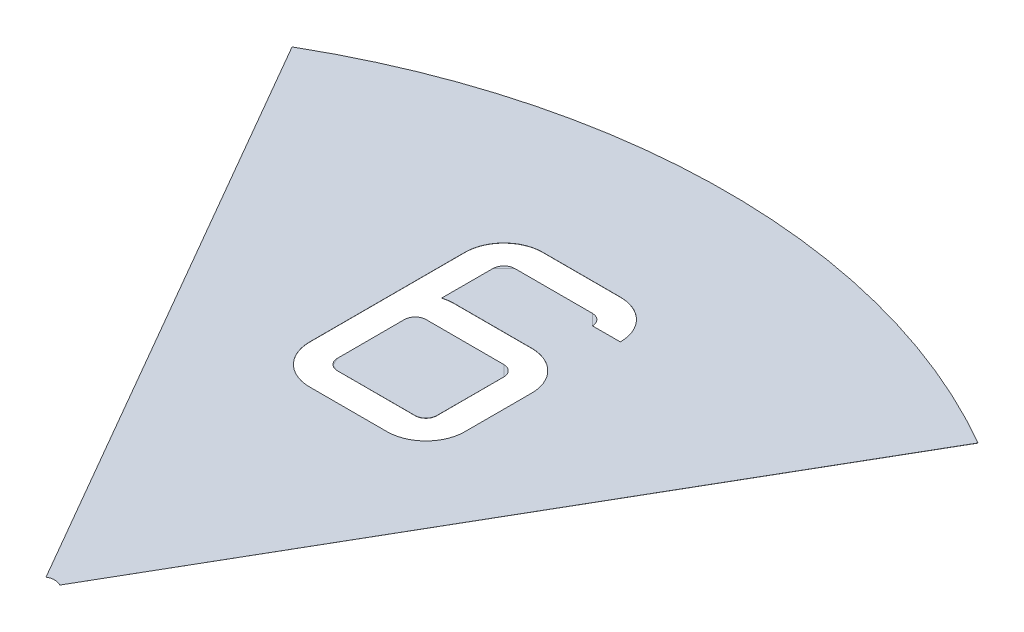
ISO-10303-21;
HEADER;
FILE_DESCRIPTION(('STEP AP214'),'2;1');
FILE_NAME('part.step','',(''),(''),'','','');
FILE_SCHEMA(('AUTOMOTIVE_DESIGN { 1 0 10303 214 1 1 1 1 }'));
ENDSEC;
DATA;
#1=APPLICATION_CONTEXT('core data for automotive mechanical design processes');
#2=APPLICATION_PROTOCOL_DEFINITION('international standard','automotive_design',2000,#1);
#3=PRODUCT_CONTEXT('',#1,'mechanical');
#4=PRODUCT('Part','Part','',(#3));
#5=PRODUCT_RELATED_PRODUCT_CATEGORY('part','',(#4));
#6=PRODUCT_DEFINITION_FORMATION('','',#4);
#7=PRODUCT_DEFINITION_CONTEXT('part definition',#1,'design');
#8=PRODUCT_DEFINITION('design','',#6,#7);
#9=PRODUCT_DEFINITION_SHAPE('','',#8);
#10=(LENGTH_UNIT() NAMED_UNIT(*) SI_UNIT(.MILLI.,.METRE.));
#11=(NAMED_UNIT(*) PLANE_ANGLE_UNIT() SI_UNIT($,.RADIAN.));
#12=(NAMED_UNIT(*) SI_UNIT($,.STERADIAN.) SOLID_ANGLE_UNIT());
#13=UNCERTAINTY_MEASURE_WITH_UNIT(LENGTH_MEASURE(1.E-05),#10,'distance_accuracy_value','');
#14=(GEOMETRIC_REPRESENTATION_CONTEXT(3) GLOBAL_UNCERTAINTY_ASSIGNED_CONTEXT((#13)) GLOBAL_UNIT_ASSIGNED_CONTEXT((#10,
#11,#12)) REPRESENTATION_CONTEXT('',''));
#15=CARTESIAN_POINT('',(0.,0.,0.));
#16=DIRECTION('',(0.,0.,1.));
#17=DIRECTION('',(1.,0.,0.));
#18=AXIS2_PLACEMENT_3D('',#15,#16,#17);
#19=CARTESIAN_POINT('',(-11.9472987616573,-17.8161671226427,-20.0961047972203));
#20=DIRECTION('',(0.,1.,0.));
#21=DIRECTION('',(0.,0.,1.));
#22=AXIS2_PLACEMENT_3D('',#19,#20,#21);
#23=CYLINDRICAL_SURFACE('',#22,0.7905);
#24=CARTESIAN_POINT('',(-11.9472987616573,-7.82616712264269,-20.0961047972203));
#25=DIRECTION('',(0.,1.,0.));
#26=DIRECTION('',(0.,0.,1.));
#27=AXIS2_PLACEMENT_3D('',#24,#25,#26);
#28=CIRCLE('',#27,0.7905);
#29=CARTESIAN_POINT('',(-11.9472987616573,-7.82616712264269,-20.8866047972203));
#30=VERTEX_POINT('',#29);
#31=CARTESIAN_POINT('',(-12.7377987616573,-7.82616712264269,-20.0961047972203));
#32=VERTEX_POINT('',#31);
#33=EDGE_CURVE('P0_E10',#30,#32,#28,.T.);
#34=ORIENTED_EDGE('',*,*,#33,.T.);
#35=DIRECTION('',(0.,1.,0.));
#36=VECTOR('',#35,1.);
#37=CARTESIAN_POINT('',(-12.7377987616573,-17.8161671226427,-20.0961047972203));
#38=LINE('',#37,#36);
#39=CARTESIAN_POINT('',(-12.7377987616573,-7.81616712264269,-20.0961047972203));
#40=VERTEX_POINT('',#39);
#41=EDGE_CURVE('P0_E31',#32,#40,#38,.T.);
#42=ORIENTED_EDGE('',*,*,#41,.T.);
#43=CARTESIAN_POINT('',(-11.9472987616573,-7.81616712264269,-20.0961047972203));
#44=DIRECTION('',(0.,1.,0.));
#45=DIRECTION('',(0.,0.,1.));
#46=AXIS2_PLACEMENT_3D('',#43,#44,#45);
#47=CIRCLE('',#46,0.7905);
#48=CARTESIAN_POINT('',(-11.9472987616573,-7.81616712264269,-20.8866047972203));
#49=VERTEX_POINT('',#48);
#50=EDGE_CURVE('P0_E67',#49,#40,#47,.T.);
#51=ORIENTED_EDGE('',*,*,#50,.F.);
#52=DIRECTION('',(0.,1.,0.));
#53=VECTOR('',#52,1.);
#54=CARTESIAN_POINT('',(-11.9472987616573,-17.8161671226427,-20.8866047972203));
#55=LINE('',#54,#53);
#56=EDGE_CURVE('P0_E37',#30,#49,#55,.T.);
#57=ORIENTED_EDGE('',*,*,#56,.F.);
#58=EDGE_LOOP('',(#34,#42,#51,#57));
#59=FACE_BOUND('',#58,.T.);
#60=ADVANCED_FACE('P0_F15',(#59),#23,.T.);
#61=CARTESIAN_POINT('',(-6.28629876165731,-17.8161671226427,-15.2171047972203));
#62=DIRECTION('',(0.,1.,0.));
#63=DIRECTION('',(0.,0.,1.));
#64=AXIS2_PLACEMENT_3D('',#61,#62,#63);
#65=CYLINDRICAL_SURFACE('',#64,0.7905);
#66=CARTESIAN_POINT('',(-6.28629876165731,-7.82616712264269,-15.2171047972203));
#67=DIRECTION('',(0.,1.,0.));
#68=DIRECTION('',(0.,0.,1.));
#69=AXIS2_PLACEMENT_3D('',#66,#67,#68);
#70=CIRCLE('',#69,0.7905);
#71=CARTESIAN_POINT('',(-6.28629876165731,-7.82616712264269,-14.4266047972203));
#72=VERTEX_POINT('',#71);
#73=CARTESIAN_POINT('',(-5.49579876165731,-7.82616712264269,-15.2171047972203));
#74=VERTEX_POINT('',#73);
#75=EDGE_CURVE('P0_E104',#72,#74,#70,.T.);
#76=ORIENTED_EDGE('',*,*,#75,.T.);
#77=DIRECTION('',(0.,1.,0.));
#78=VECTOR('',#77,1.);
#79=CARTESIAN_POINT('',(-5.49579876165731,-17.8161671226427,-15.2171047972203));
#80=LINE('',#79,#78);
#81=CARTESIAN_POINT('',(-5.49579876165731,-7.81616712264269,-15.2171047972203));
#82=VERTEX_POINT('',#81);
#83=EDGE_CURVE('P0_E85',#74,#82,#80,.T.);
#84=ORIENTED_EDGE('',*,*,#83,.T.);
#85=CARTESIAN_POINT('',(-6.28629876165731,-7.81616712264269,-15.2171047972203));
#86=DIRECTION('',(0.,1.,0.));
#87=DIRECTION('',(0.,0.,1.));
#88=AXIS2_PLACEMENT_3D('',#85,#86,#87);
#89=CIRCLE('',#88,0.7905);
#90=CARTESIAN_POINT('',(-6.28629876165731,-7.81616712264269,-14.4266047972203));
#91=VERTEX_POINT('',#90);
#92=EDGE_CURVE('P0_E88',#91,#82,#89,.T.);
#93=ORIENTED_EDGE('',*,*,#92,.F.);
#94=DIRECTION('',(0.,1.,0.));
#95=VECTOR('',#94,1.);
#96=CARTESIAN_POINT('',(-6.28629876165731,-17.8161671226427,-14.4266047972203));
#97=LINE('',#96,#95);
#98=EDGE_CURVE('P0_E91',#72,#91,#97,.T.);
#99=ORIENTED_EDGE('',*,*,#98,.F.);
#100=EDGE_LOOP('',(#76,#84,#93,#99));
#101=FACE_BOUND('',#100,.T.);
#102=ADVANCED_FACE('P0_F144',(#101),#65,.T.);
#103=CARTESIAN_POINT('',(-11.9472987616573,-17.8161671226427,-20.8866047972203));
#104=DIRECTION('',(0.,0.,-1.));
#105=DIRECTION('',(-1.,0.,0.));
#106=AXIS2_PLACEMENT_3D('',#103,#104,#105);
#107=PLANE('',#106);
#108=CARTESIAN_POINT('',(-6.28629876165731,-7.82616712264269,-20.8866047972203));
#109=CARTESIAN_POINT('',(-11.9472987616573,-7.82616712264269,-20.8866047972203));
#110=B_SPLINE_CURVE_WITH_KNOTS('',1,(#108,#109),.UNSPECIFIED.,.F.,.F.,(2,2),(0.,1.),.UNSPECIFIED.);
#111=CARTESIAN_POINT('',(-6.28629876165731,-7.82116712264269,-20.8866047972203));
#112=VERTEX_POINT('',#111);
#113=EDGE_CURVE('P0_E24',#112,#30,#110,.T.);
#114=ORIENTED_EDGE('',*,*,#113,.T.);
#115=ORIENTED_EDGE('',*,*,#56,.T.);
#116=DIRECTION('',(-1.,0.,0.));
#117=VECTOR('',#116,1.);
#118=CARTESIAN_POINT('',(-11.9472987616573,-7.81616712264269,-20.8866047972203));
#119=LINE('',#118,#117);
#120=EDGE_CURVE('P0_E83',#112,#49,#119,.T.);
#121=ORIENTED_EDGE('',*,*,#120,.F.);
#122=EDGE_LOOP('',(#114,#115,#121));
#123=FACE_BOUND('',#122,.T.);
#124=ADVANCED_FACE('P0_F154',(#123),#107,.T.);
#125=CARTESIAN_POINT('',(-5.49579876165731,-17.8161671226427,-15.2171047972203));
#126=DIRECTION('',(1.,0.,0.));
#127=DIRECTION('',(0.,0.,-1.));
#128=AXIS2_PLACEMENT_3D('',#125,#126,#127);
#129=PLANE('',#128);
#130=CARTESIAN_POINT('',(-5.49579876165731,-7.82616712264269,-15.2171047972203));
#131=CARTESIAN_POINT('',(-5.49579876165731,-7.82616712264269,-20.0961047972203));
#132=B_SPLINE_CURVE_WITH_KNOTS('',1,(#130,#131),.UNSPECIFIED.,.F.,.F.,(2,2),(0.,1.),.UNSPECIFIED.);
#133=CARTESIAN_POINT('',(-5.49579876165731,-7.82116712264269,-20.0961047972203));
#134=VERTEX_POINT('',#133);
#135=EDGE_CURVE('P0_E109',#74,#134,#132,.T.);
#136=ORIENTED_EDGE('',*,*,#135,.T.);
#137=DIRECTION('',(0.,0.,-1.));
#138=VECTOR('',#137,1.);
#139=CARTESIAN_POINT('',(-5.49579876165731,-7.81616712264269,-15.2171047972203));
#140=LINE('',#139,#138);
#141=EDGE_CURVE('P0_E79',#82,#134,#140,.T.);
#142=ORIENTED_EDGE('',*,*,#141,.F.);
#143=ORIENTED_EDGE('',*,*,#83,.F.);
#144=EDGE_LOOP('',(#136,#142,#143));
#145=FACE_BOUND('',#144,.T.);
#146=ADVANCED_FACE('P0_F157',(#145),#129,.T.);
#147=CARTESIAN_POINT('',(-12.7377987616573,-17.8161671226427,-20.0961047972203));
#148=DIRECTION('',(-1.,0.,0.));
#149=DIRECTION('',(0.,0.,1.));
#150=AXIS2_PLACEMENT_3D('',#147,#148,#149);
#151=PLANE('',#150);
#152=CARTESIAN_POINT('',(-12.7377987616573,-7.82616712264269,-20.0961047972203));
#153=CARTESIAN_POINT('',(-12.7377987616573,-7.82616712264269,-15.2171047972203));
#154=B_SPLINE_CURVE_WITH_KNOTS('',1,(#152,#153),.UNSPECIFIED.,.F.,.F.,(2,2),(0.,1.),.UNSPECIFIED.);
#155=CARTESIAN_POINT('',(-12.7377987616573,-7.82116712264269,-15.2171047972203));
#156=VERTEX_POINT('',#155);
#157=EDGE_CURVE('P0_E74',#32,#156,#154,.T.);
#158=ORIENTED_EDGE('',*,*,#157,.T.);
#159=DIRECTION('',(0.,0.,1.));
#160=VECTOR('',#159,1.);
#161=CARTESIAN_POINT('',(-12.7377987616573,-7.81616712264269,-20.0961047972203));
#162=LINE('',#161,#160);
#163=EDGE_CURVE('P0_E72',#40,#156,#162,.T.);
#164=ORIENTED_EDGE('',*,*,#163,.F.);
#165=ORIENTED_EDGE('',*,*,#41,.F.);
#166=EDGE_LOOP('',(#158,#164,#165));
#167=FACE_BOUND('',#166,.T.);
#168=ADVANCED_FACE('P0_F73',(#167),#151,.T.);
#169=CARTESIAN_POINT('',(-9.04331643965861,-7.81616712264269,10.0890172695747));
#170=DIRECTION('',(0.,1.,0.));
#171=DIRECTION('',(0.,0.,1.));
#172=AXIS2_PLACEMENT_3D('',#169,#170,#171);
#173=PLANE('',#172);
#174=ORIENTED_EDGE('',*,*,#120,.T.);
#175=ORIENTED_EDGE('',*,*,#50,.T.);
#176=ORIENTED_EDGE('',*,*,#163,.T.);
#177=CARTESIAN_POINT('',(-12.7377987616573,-7.81616712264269,-15.2171047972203));
#178=CARTESIAN_POINT('',(-12.736462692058,-7.81616712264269,-14.8861691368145));
#179=CARTESIAN_POINT('',(-12.5062666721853,-7.81616712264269,-14.6581368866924));
#180=CARTESIAN_POINT('',(-12.273868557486,-7.81616712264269,-14.4279232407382));
#181=CARTESIAN_POINT('',(-11.9472987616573,-7.81616712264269,-14.4266047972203));
#182=B_SPLINE_CURVE_WITH_KNOTS('',2,(#177,#178,#179,#180,#181),.UNSPECIFIED.,.F.,.F.,(3,2,3),
(0.,0.5,1.),.UNSPECIFIED.);
#183=CARTESIAN_POINT('',(-11.9472987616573,-7.82116712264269,-14.4266047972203));
#184=VERTEX_POINT('',#183);
#185=EDGE_CURVE('P0_E93',#156,#184,#182,.T.);
#186=ORIENTED_EDGE('',*,*,#185,.T.);
#187=DIRECTION('',(1.,0.,0.));
#188=VECTOR('',#187,1.);
#189=CARTESIAN_POINT('',(-11.9472987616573,-7.81616712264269,-14.4266047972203));
#190=LINE('',#189,#188);
#191=EDGE_CURVE('P0_E78',#184,#91,#190,.T.);
#192=ORIENTED_EDGE('',*,*,#191,.T.);
#193=ORIENTED_EDGE('',*,*,#92,.T.);
#194=ORIENTED_EDGE('',*,*,#141,.T.);
#195=CARTESIAN_POINT('',(-5.49579876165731,-7.81616712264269,-20.0961047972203));
#196=CARTESIAN_POINT('',(-5.49713483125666,-7.81616712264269,-20.4270404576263));
#197=CARTESIAN_POINT('',(-5.72733085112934,-7.81616712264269,-20.6550727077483));
#198=CARTESIAN_POINT('',(-5.959728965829,-7.81616712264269,-20.8852863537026));
#199=CARTESIAN_POINT('',(-6.28629876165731,-7.81616712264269,-20.8866047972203));
#200=B_SPLINE_CURVE_WITH_KNOTS('',2,(#195,#196,#197,#198,#199),.UNSPECIFIED.,.F.,.F.,(3,2,3),
(0.,0.5,1.),.UNSPECIFIED.);
#201=EDGE_CURVE('P0_E115',#134,#112,#200,.T.);
#202=ORIENTED_EDGE('',*,*,#201,.T.);
#203=EDGE_LOOP('',(#174,#175,#176,#186,#192,#193,#194,#202));
#204=FACE_BOUND('',#203,.T.);
#205=ADVANCED_FACE('P0_F81',(#204),#173,.T.);
#206=CARTESIAN_POINT('',(-11.9472987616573,-17.8161671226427,-14.4266047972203));
#207=DIRECTION('',(0.,0.,1.));
#208=DIRECTION('',(1.,0.,0.));
#209=AXIS2_PLACEMENT_3D('',#206,#207,#208);
#210=PLANE('',#209);
#211=CARTESIAN_POINT('',(-11.9472987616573,-7.82616712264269,-14.4266047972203));
#212=CARTESIAN_POINT('',(-6.28629876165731,-7.82616712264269,-14.4266047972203));
#213=B_SPLINE_CURVE_WITH_KNOTS('',1,(#211,#212),.UNSPECIFIED.,.F.,.F.,(2,2),(0.,1.),.UNSPECIFIED.);
#214=EDGE_CURVE('P0_E98',#184,#72,#213,.T.);
#215=ORIENTED_EDGE('',*,*,#214,.T.);
#216=ORIENTED_EDGE('',*,*,#98,.T.);
#217=ORIENTED_EDGE('',*,*,#191,.F.);
#218=EDGE_LOOP('',(#215,#216,#217));
#219=FACE_BOUND('',#218,.T.);
#220=ADVANCED_FACE('P0_F166',(#219),#210,.T.);
#221=CARTESIAN_POINT('',(-9.04331643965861,-7.82616712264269,10.0890172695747));
#222=DIRECTION('',(0.,1.,0.));
#223=DIRECTION('',(0.,0.,1.));
#224=AXIS2_PLACEMENT_3D('',#221,#222,#223);
#225=PLANE('',#224);
#226=ORIENTED_EDGE('',*,*,#157,.F.);
#227=ORIENTED_EDGE('',*,*,#33,.F.);
#228=ORIENTED_EDGE('',*,*,#113,.F.);
#229=ORIENTED_EDGE('',*,*,#201,.F.);
#230=ORIENTED_EDGE('',*,*,#135,.F.);
#231=ORIENTED_EDGE('',*,*,#75,.F.);
#232=ORIENTED_EDGE('',*,*,#214,.F.);
#233=ORIENTED_EDGE('',*,*,#185,.F.);
#234=EDGE_LOOP('',(#226,#227,#228,#229,#230,#231,#232,#233));
#235=FACE_BOUND('',#234,.T.);
#236=ADVANCED_FACE('P0_F17',(#235),#225,.F.);
#237=CLOSED_SHELL('',(#60,#102,#124,#146,#168,#205,#220,#236));
#238=MANIFOLD_SOLID_BREP('P0_B1',#237);
#239=CARTESIAN_POINT('',(-6.28629876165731,-17.8161671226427,-26.5561047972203));
#240=DIRECTION('',(0.,1.,0.));
#241=DIRECTION('',(0.,0.,1.));
#242=AXIS2_PLACEMENT_3D('',#239,#240,#241);
#243=CYLINDRICAL_SURFACE('',#242,2.8305);
#244=DIRECTION('',(0.,1.,0.));
#245=VECTOR('',#244,1.);
#246=CARTESIAN_POINT('',(-3.45579876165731,-17.8161671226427,-26.5561047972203));
#247=LINE('',#246,#245);
#248=CARTESIAN_POINT('',(-3.45579876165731,-7.82616712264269,-26.5561047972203));
#249=VERTEX_POINT('',#248);
#250=CARTESIAN_POINT('',(-3.45579876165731,-7.81616712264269,-26.5561047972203));
#251=VERTEX_POINT('',#250);
#252=EDGE_CURVE('P1_E574',#249,#251,#247,.T.);
#253=ORIENTED_EDGE('',*,*,#252,.T.);
#254=CARTESIAN_POINT('',(-6.28629876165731,-7.81616712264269,-26.5561047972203));
#255=DIRECTION('',(0.,1.,0.));
#256=DIRECTION('',(0.,0.,-1.));
#257=AXIS2_PLACEMENT_3D('',#254,#255,#256);
#258=CIRCLE('',#257,2.8305);
#259=CARTESIAN_POINT('',(-6.28629876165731,-7.81616712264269,-29.3866047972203));
#260=VERTEX_POINT('',#259);
#261=EDGE_CURVE('P1_E372',#251,#260,#258,.T.);
#262=ORIENTED_EDGE('',*,*,#261,.T.);
#263=DIRECTION('',(0.,1.,0.));
#264=VECTOR('',#263,1.);
#265=CARTESIAN_POINT('',(-6.28629876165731,-17.8161671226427,-29.3866047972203));
#266=LINE('',#265,#264);
#267=CARTESIAN_POINT('',(-6.28629876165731,-7.82616712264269,-29.3866047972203));
#268=VERTEX_POINT('',#267);
#269=EDGE_CURVE('P1_E363',#268,#260,#266,.T.);
#270=ORIENTED_EDGE('',*,*,#269,.F.);
#271=CARTESIAN_POINT('',(-3.45579876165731,-7.82616712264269,-26.5561047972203));
#272=CARTESIAN_POINT('',(-3.45584685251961,-7.82616712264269,-26.8163152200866));
#273=CARTESIAN_POINT('',(-3.5030529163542,-7.82616712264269,-27.0711512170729));
#274=CARTESIAN_POINT('',(-3.55330936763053,-7.82616712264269,-27.3424543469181));
#275=CARTESIAN_POINT('',(-3.6545329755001,-7.82616712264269,-27.5979968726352));
#276=CARTESIAN_POINT('',(-3.76040454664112,-7.82616712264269,-27.8652733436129));
#277=CARTESIAN_POINT('',(-3.91718296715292,-7.82616712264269,-28.104982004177));
#278=CARTESIAN_POINT('',(-4.07790125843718,-7.82616712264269,-28.3507145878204));
#279=CARTESIAN_POINT('',(-4.28483301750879,-7.82616712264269,-28.5575705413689));
#280=CARTESIAN_POINT('',(-4.49249431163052,-7.82616712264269,-28.7651557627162));
#281=CARTESIAN_POINT('',(-4.73742155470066,-7.82616712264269,-28.9252205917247));
#282=CARTESIAN_POINT('',(-4.97807080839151,-7.82616712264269,-29.0824896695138));
#283=CARTESIAN_POINT('',(-5.24440668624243,-7.82616712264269,-29.1878705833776));
#284=CARTESIAN_POINT('',(-5.50097183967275,-7.82616712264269,-29.2893855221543));
#285=CARTESIAN_POINT('',(-5.77125234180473,-7.82616712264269,-29.3393506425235));
#286=CARTESIAN_POINT('',(-6.02660856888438,-7.82616712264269,-29.3865568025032));
#287=CARTESIAN_POINT('',(-6.28629876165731,-7.82616712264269,-29.3866047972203));
#288=B_SPLINE_CURVE_WITH_KNOTS('',2,(#271,#272,#273,#274,#275,#276,#277,#278,#279,#280,#281,
#282,#283,#284,#285,#286,#287),.UNSPECIFIED.,.F.,.F.,(3,2,2,2,2,2,2,2,3),(0.,0.125,0.25,0.375,
0.5,0.625,0.75,0.875,1.),.UNSPECIFIED.);
#289=EDGE_CURVE('P1_E279',#249,#268,#288,.T.);
#290=ORIENTED_EDGE('',*,*,#289,.F.);
#291=EDGE_LOOP('',(#253,#262,#270,#290));
#292=FACE_BOUND('',#291,.T.);
#293=ADVANCED_FACE('P1_F15',(#292),#243,.F.);
#294=CARTESIAN_POINT('',(-6.28629876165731,-17.8161671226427,-29.3866047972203));
#295=DIRECTION('',(0.,0.,-1.));
#296=DIRECTION('',(-1.,0.,0.));
#297=AXIS2_PLACEMENT_3D('',#294,#295,#296);
#298=PLANE('',#297);
#299=ORIENTED_EDGE('',*,*,#269,.T.);
#300=DIRECTION('',(-1.,0.,0.));
#301=VECTOR('',#300,1.);
#302=CARTESIAN_POINT('',(-6.28629876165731,-7.81616712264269,-29.3866047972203));
#303=LINE('',#302,#301);
#304=CARTESIAN_POINT('',(-11.9472987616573,-7.81616712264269,-29.3866047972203));
#305=VERTEX_POINT('',#304);
#306=EDGE_CURVE('P1_E371',#260,#305,#303,.T.);
#307=ORIENTED_EDGE('',*,*,#306,.T.);
#308=DIRECTION('',(0.,1.,0.));
#309=VECTOR('',#308,1.);
#310=CARTESIAN_POINT('',(-11.9472987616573,-17.8161671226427,-29.3866047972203));
#311=LINE('',#310,#309);
#312=CARTESIAN_POINT('',(-11.9472987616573,-7.82616712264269,-29.3866047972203));
#313=VERTEX_POINT('',#312);
#314=EDGE_CURVE('P1_E380',#313,#305,#311,.T.);
#315=ORIENTED_EDGE('',*,*,#314,.F.);
#316=CARTESIAN_POINT('',(-6.28629876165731,-7.82616712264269,-29.3866047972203));
#317=CARTESIAN_POINT('',(-11.9472987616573,-7.82616712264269,-29.3866047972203));
#318=B_SPLINE_CURVE_WITH_KNOTS('',1,(#316,#317),.UNSPECIFIED.,.F.,.F.,(2,2),(0.,1.),.UNSPECIFIED.);
#319=EDGE_CURVE('P1_E273',#268,#313,#318,.T.);
#320=ORIENTED_EDGE('',*,*,#319,.F.);
#321=EDGE_LOOP('',(#299,#307,#315,#320));
#322=FACE_BOUND('',#321,.T.);
#323=ADVANCED_FACE('P1_F344',(#322),#298,.F.);
#324=CARTESIAN_POINT('',(-11.9472987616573,-17.8161671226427,-26.5561047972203));
#325=DIRECTION('',(0.,1.,0.));
#326=DIRECTION('',(0.,0.,1.));
#327=AXIS2_PLACEMENT_3D('',#324,#325,#326);
#328=CYLINDRICAL_SURFACE('',#327,2.8305);
#329=ORIENTED_EDGE('',*,*,#314,.T.);
#330=CARTESIAN_POINT('',(-11.9472987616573,-7.81616712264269,-26.5561047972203));
#331=DIRECTION('',(0.,1.,0.));
#332=DIRECTION('',(0.,0.,1.));
#333=AXIS2_PLACEMENT_3D('',#330,#331,#332);
#334=CIRCLE('',#333,2.8305);
#335=CARTESIAN_POINT('',(-14.7777987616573,-7.81616712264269,-26.5561047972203));
#336=VERTEX_POINT('',#335);
#337=EDGE_CURVE('P1_E388',#305,#336,#334,.T.);
#338=ORIENTED_EDGE('',*,*,#337,.T.);
#339=DIRECTION('',(0.,1.,0.));
#340=VECTOR('',#339,1.);
#341=CARTESIAN_POINT('',(-14.7777987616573,-17.8161671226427,-26.5561047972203));
#342=LINE('',#341,#340);
#343=CARTESIAN_POINT('',(-14.7777987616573,-7.82616712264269,-26.5561047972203));
#344=VERTEX_POINT('',#343);
#345=EDGE_CURVE('P1_E398',#344,#336,#342,.T.);
#346=ORIENTED_EDGE('',*,*,#345,.F.);
#347=CARTESIAN_POINT('',(-11.9472987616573,-7.82616712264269,-29.3866047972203));
#348=CARTESIAN_POINT('',(-12.2075091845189,-7.82616712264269,-29.3865567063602));
#349=CARTESIAN_POINT('',(-12.4623451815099,-7.82616712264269,-29.3393506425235));
#350=CARTESIAN_POINT('',(-12.733648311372,-7.82616712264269,-29.2890941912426));
#351=CARTESIAN_POINT('',(-12.9891908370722,-7.82616712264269,-29.1878705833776));
#352=CARTESIAN_POINT('',(-13.2564673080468,-7.82616712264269,-29.0819990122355));
#353=CARTESIAN_POINT('',(-13.496175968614,-7.82616712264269,-28.9252205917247));
#354=CARTESIAN_POINT('',(-13.7419085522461,-7.82616712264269,-28.7645023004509));
#355=CARTESIAN_POINT('',(-13.9487645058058,-7.82616712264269,-28.5575705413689));
#356=CARTESIAN_POINT('',(-14.1563497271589,-7.82616712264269,-28.3499092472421));
#357=CARTESIAN_POINT('',(-14.3164145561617,-7.82616712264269,-28.104982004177));
#358=CARTESIAN_POINT('',(-14.4736836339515,-7.82616712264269,-27.8643327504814));
#359=CARTESIAN_POINT('',(-14.5790645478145,-7.82616712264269,-27.5979968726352));
#360=CARTESIAN_POINT('',(-14.6805794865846,-7.82616712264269,-27.3414317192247));
#361=CARTESIAN_POINT('',(-14.7305446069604,-7.82616712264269,-27.0711512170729));
#362=CARTESIAN_POINT('',(-14.7777507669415,-7.82616712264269,-26.8157949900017));
#363=CARTESIAN_POINT('',(-14.7777987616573,-7.82616712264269,-26.5561047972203));
#364=B_SPLINE_CURVE_WITH_KNOTS('',2,(#347,#348,#349,#350,#351,#352,#353,#354,#355,#356,#357,
#358,#359,#360,#361,#362,#363),.UNSPECIFIED.,.F.,.F.,(3,2,2,2,2,2,2,2,3),(0.,0.125,0.25,0.375,
0.5,0.625,0.75,0.875,1.),.UNSPECIFIED.);
#365=EDGE_CURVE('P1_E268',#313,#344,#364,.T.);
#366=ORIENTED_EDGE('',*,*,#365,.F.);
#367=EDGE_LOOP('',(#329,#338,#346,#366));
#368=FACE_BOUND('',#367,.T.);
#369=ADVANCED_FACE('P1_F350',(#368),#328,.F.);
#370=CARTESIAN_POINT('',(-14.7777987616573,-17.8161671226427,-26.5561047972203));
#371=DIRECTION('',(-1.,0.,0.));
#372=DIRECTION('',(0.,0.,1.));
#373=AXIS2_PLACEMENT_3D('',#370,#371,#372);
#374=PLANE('',#373);
#375=ORIENTED_EDGE('',*,*,#345,.T.);
#376=DIRECTION('',(0.,0.,1.));
#377=VECTOR('',#376,1.);
#378=CARTESIAN_POINT('',(-14.7777987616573,-7.81616712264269,-26.5561047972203));
#379=LINE('',#378,#377);
#380=CARTESIAN_POINT('',(-14.7777987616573,-7.81616712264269,-15.2171047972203));
#381=VERTEX_POINT('',#380);
#382=EDGE_CURVE('P1_E591',#336,#381,#379,.T.);
#383=ORIENTED_EDGE('',*,*,#382,.T.);
#384=DIRECTION('',(0.,1.,0.));
#385=VECTOR('',#384,1.);
#386=CARTESIAN_POINT('',(-14.7777987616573,-17.8161671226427,-15.2171047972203));
#387=LINE('',#386,#385);
#388=CARTESIAN_POINT('',(-14.7777987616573,-7.82616712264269,-15.2171047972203));
#389=VERTEX_POINT('',#388);
#390=EDGE_CURVE('P1_E594',#389,#381,#387,.T.);
#391=ORIENTED_EDGE('',*,*,#390,.F.);
#392=CARTESIAN_POINT('',(-14.7777987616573,-7.82616712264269,-26.5561047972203));
#393=CARTESIAN_POINT('',(-14.7777987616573,-7.82616712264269,-15.2171047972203));
#394=B_SPLINE_CURVE_WITH_KNOTS('',1,(#392,#393),.UNSPECIFIED.,.F.,.F.,(2,2),(0.,1.),.UNSPECIFIED.);
#395=EDGE_CURVE('P1_E262',#344,#389,#394,.T.);
#396=ORIENTED_EDGE('',*,*,#395,.F.);
#397=EDGE_LOOP('',(#375,#383,#391,#396));
#398=FACE_BOUND('',#397,.T.);
#399=ADVANCED_FACE('P1_F408',(#398),#374,.F.);
#400=CARTESIAN_POINT('',(-11.9472987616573,-17.8161671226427,-15.2171047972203));
#401=DIRECTION('',(0.,1.,0.));
#402=DIRECTION('',(0.,0.,1.));
#403=AXIS2_PLACEMENT_3D('',#400,#401,#402);
#404=CYLINDRICAL_SURFACE('',#403,2.8305);
#405=ORIENTED_EDGE('',*,*,#390,.T.);
#406=CARTESIAN_POINT('',(-11.9472987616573,-7.81616712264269,-15.2171047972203));
#407=DIRECTION('',(0.,1.,0.));
#408=DIRECTION('',(0.,0.,1.));
#409=AXIS2_PLACEMENT_3D('',#406,#407,#408);
#410=CIRCLE('',#409,2.8305);
#411=CARTESIAN_POINT('',(-11.9472987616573,-7.81616712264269,-12.3866047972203));
#412=VERTEX_POINT('',#411);
#413=EDGE_CURVE('P1_E435',#381,#412,#410,.T.);
#414=ORIENTED_EDGE('',*,*,#413,.T.);
#415=DIRECTION('',(0.,1.,0.));
#416=VECTOR('',#415,1.);
#417=CARTESIAN_POINT('',(-11.9472987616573,-17.8161671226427,-12.3866047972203));
#418=LINE('',#417,#416);
#419=CARTESIAN_POINT('',(-11.9472987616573,-7.82616712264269,-12.3866047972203));
#420=VERTEX_POINT('',#419);
#421=EDGE_CURVE('P1_E426',#420,#412,#418,.T.);
#422=ORIENTED_EDGE('',*,*,#421,.F.);
#423=CARTESIAN_POINT('',(-14.7777987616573,-7.82616712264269,-15.2171047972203));
#424=CARTESIAN_POINT('',(-14.7777506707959,-7.82616712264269,-14.9568943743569));
#425=CARTESIAN_POINT('',(-14.7305446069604,-7.82616712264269,-14.7020583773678));
#426=CARTESIAN_POINT('',(-14.6802881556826,-7.82616712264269,-14.4307552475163));
#427=CARTESIAN_POINT('',(-14.5790645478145,-7.82616712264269,-14.1752127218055));
#428=CARTESIAN_POINT('',(-14.4731929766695,-7.82616712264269,-13.9079362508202));
#429=CARTESIAN_POINT('',(-14.3164145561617,-7.82616712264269,-13.6682275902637));
#430=CARTESIAN_POINT('',(-14.1556962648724,-7.82616712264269,-13.422495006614));
#431=CARTESIAN_POINT('',(-13.9487645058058,-7.82616712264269,-13.2156390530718));
#432=CARTESIAN_POINT('',(-13.7411032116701,-7.82616712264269,-13.0080538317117));
#433=CARTESIAN_POINT('',(-13.496175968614,-7.82616712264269,-12.8479890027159));
#434=CARTESIAN_POINT('',(-13.2555267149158,-7.82616712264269,-12.6907199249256));
#435=CARTESIAN_POINT('',(-12.9891908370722,-7.82616712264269,-12.5853390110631));
#436=CARTESIAN_POINT('',(-12.7326256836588,-7.82616712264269,-12.4838240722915));
#437=CARTESIAN_POINT('',(-12.4623451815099,-7.82616712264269,-12.4338589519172));
#438=CARTESIAN_POINT('',(-12.206988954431,-7.82616712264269,-12.3866527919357));
#439=CARTESIAN_POINT('',(-11.9472987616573,-7.82616712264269,-12.3866047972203));
#440=B_SPLINE_CURVE_WITH_KNOTS('',2,(#423,#424,#425,#426,#427,#428,#429,#430,#431,#432,#433,
#434,#435,#436,#437,#438,#439),.UNSPECIFIED.,.F.,.F.,(3,2,2,2,2,2,2,2,3),(0.,0.125,0.25,0.375,
0.5,0.625,0.75,0.875,1.),.UNSPECIFIED.);
#441=EDGE_CURVE('P1_E257',#389,#420,#440,.T.);
#442=ORIENTED_EDGE('',*,*,#441,.F.);
#443=EDGE_LOOP('',(#405,#414,#422,#442));
#444=FACE_BOUND('',#443,.T.);
#445=ADVANCED_FACE('P1_F411',(#444),#404,.F.);
#446=CARTESIAN_POINT('',(-11.9472987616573,-17.8161671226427,-12.3866047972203));
#447=DIRECTION('',(0.,0.,1.));
#448=DIRECTION('',(1.,0.,0.));
#449=AXIS2_PLACEMENT_3D('',#446,#447,#448);
#450=PLANE('',#449);
#451=ORIENTED_EDGE('',*,*,#421,.T.);
#452=DIRECTION('',(1.,0.,0.));
#453=VECTOR('',#452,1.);
#454=CARTESIAN_POINT('',(-11.9472987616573,-7.81616712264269,-12.3866047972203));
#455=LINE('',#454,#453);
#456=CARTESIAN_POINT('',(-6.28629876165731,-7.81616712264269,-12.3866047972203));
#457=VERTEX_POINT('',#456);
#458=EDGE_CURVE('P1_E434',#412,#457,#455,.T.);
#459=ORIENTED_EDGE('',*,*,#458,.T.);
#460=DIRECTION('',(0.,1.,0.));
#461=VECTOR('',#460,1.);
#462=CARTESIAN_POINT('',(-6.28629876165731,-17.8161671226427,-12.3866047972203));
#463=LINE('',#462,#461);
#464=CARTESIAN_POINT('',(-6.28629876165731,-7.82616712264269,-12.3866047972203));
#465=VERTEX_POINT('',#464);
#466=EDGE_CURVE('P1_E443',#465,#457,#463,.T.);
#467=ORIENTED_EDGE('',*,*,#466,.F.);
#468=CARTESIAN_POINT('',(-11.9472987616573,-7.82616712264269,-12.3866047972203));
#469=CARTESIAN_POINT('',(-6.28629876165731,-7.82616712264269,-12.3866047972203));
#470=B_SPLINE_CURVE_WITH_KNOTS('',1,(#468,#469),.UNSPECIFIED.,.F.,.F.,(2,2),(0.,1.),.UNSPECIFIED.);
#471=EDGE_CURVE('P1_E251',#420,#465,#470,.T.);
#472=ORIENTED_EDGE('',*,*,#471,.F.);
#473=EDGE_LOOP('',(#451,#459,#467,#472));
#474=FACE_BOUND('',#473,.T.);
#475=ADVANCED_FACE('P1_F416',(#474),#450,.F.);
#476=CARTESIAN_POINT('',(-6.28629876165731,-17.8161671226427,-15.2171047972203));
#477=DIRECTION('',(0.,1.,0.));
#478=DIRECTION('',(0.,0.,1.));
#479=AXIS2_PLACEMENT_3D('',#476,#477,#478);
#480=CYLINDRICAL_SURFACE('',#479,2.8305);
#481=ORIENTED_EDGE('',*,*,#466,.T.);
#482=CARTESIAN_POINT('',(-6.28629876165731,-7.81616712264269,-15.2171047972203));
#483=DIRECTION('',(0.,1.,0.));
#484=DIRECTION('',(0.,0.,1.));
#485=AXIS2_PLACEMENT_3D('',#482,#483,#484);
#486=CIRCLE('',#485,2.8305);
#487=CARTESIAN_POINT('',(-3.45579876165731,-7.81616712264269,-15.2171047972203));
#488=VERTEX_POINT('',#487);
#489=EDGE_CURVE('P1_E451',#457,#488,#486,.T.);
#490=ORIENTED_EDGE('',*,*,#489,.T.);
#491=DIRECTION('',(0.,1.,0.));
#492=VECTOR('',#491,1.);
#493=CARTESIAN_POINT('',(-3.45579876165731,-17.8161671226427,-15.2171047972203));
#494=LINE('',#493,#492);
#495=CARTESIAN_POINT('',(-3.45579876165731,-7.82616712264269,-15.2171047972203));
#496=VERTEX_POINT('',#495);
#497=EDGE_CURVE('P1_E461',#496,#488,#494,.T.);
#498=ORIENTED_EDGE('',*,*,#497,.F.);
#499=CARTESIAN_POINT('',(-6.28629876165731,-7.82616712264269,-12.3866047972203));
#500=CARTESIAN_POINT('',(-6.02608833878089,-7.82616712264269,-12.3866528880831));
#501=CARTESIAN_POINT('',(-5.77125234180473,-7.82616712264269,-12.4338589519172));
#502=CARTESIAN_POINT('',(-5.49994921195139,-7.82616712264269,-12.4841154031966));
#503=CARTESIAN_POINT('',(-5.24440668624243,-7.82616712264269,-12.5853390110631));
#504=CARTESIAN_POINT('',(-4.9771302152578,-7.82616712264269,-12.6912105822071));
#505=CARTESIAN_POINT('',(-4.73742155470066,-7.82616712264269,-12.8479890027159));
#506=CARTESIAN_POINT('',(-4.4916889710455,-7.82616712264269,-13.0087072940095));
#507=CARTESIAN_POINT('',(-4.28483301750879,-7.82616712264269,-13.2156390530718));
#508=CARTESIAN_POINT('',(-4.07724779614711,-7.82616712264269,-13.4233003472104));
#509=CARTESIAN_POINT('',(-3.91718296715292,-7.82616712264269,-13.6682275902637));
#510=CARTESIAN_POINT('',(-3.75991388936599,-7.82616712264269,-13.9088768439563));
#511=CARTESIAN_POINT('',(-3.6545329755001,-7.82616712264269,-14.1752127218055));
#512=CARTESIAN_POINT('',(-3.55301803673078,-7.82616712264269,-14.4317778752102));
#513=CARTESIAN_POINT('',(-3.5030529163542,-7.82616712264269,-14.7020583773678));
#514=CARTESIAN_POINT('',(-3.45584675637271,-7.82616712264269,-14.9574146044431));
#515=CARTESIAN_POINT('',(-3.45579876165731,-7.82616712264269,-15.2171047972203));
#516=B_SPLINE_CURVE_WITH_KNOTS('',2,(#499,#500,#501,#502,#503,#504,#505,#506,#507,#508,#509,
#510,#511,#512,#513,#514,#515),.UNSPECIFIED.,.F.,.F.,(3,2,2,2,2,2,2,2,3),(0.,0.125,0.25,0.375,
0.5,0.625,0.75,0.875,1.),.UNSPECIFIED.);
#517=EDGE_CURVE('P1_E246',#465,#496,#516,.T.);
#518=ORIENTED_EDGE('',*,*,#517,.F.);
#519=EDGE_LOOP('',(#481,#490,#498,#518));
#520=FACE_BOUND('',#519,.T.);
#521=ADVANCED_FACE('P1_F463',(#520),#480,.F.);
#522=CARTESIAN_POINT('',(-3.45579876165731,-17.8161671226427,-15.2171047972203));
#523=DIRECTION('',(1.,0.,0.));
#524=DIRECTION('',(0.,0.,-1.));
#525=AXIS2_PLACEMENT_3D('',#522,#523,#524);
#526=PLANE('',#525);
#527=ORIENTED_EDGE('',*,*,#497,.T.);
#528=DIRECTION('',(0.,0.,-1.));
#529=VECTOR('',#528,1.);
#530=CARTESIAN_POINT('',(-3.45579876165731,-7.81616712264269,-15.2171047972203));
#531=LINE('',#530,#529);
#532=CARTESIAN_POINT('',(-3.45579876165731,-7.81616712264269,-20.0961047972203));
#533=VERTEX_POINT('',#532);
#534=EDGE_CURVE('P1_E601',#488,#533,#531,.T.);
#535=ORIENTED_EDGE('',*,*,#534,.T.);
#536=DIRECTION('',(0.,1.,0.));
#537=VECTOR('',#536,1.);
#538=CARTESIAN_POINT('',(-3.45579876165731,-17.8161671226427,-20.0961047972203));
#539=LINE('',#538,#537);
#540=CARTESIAN_POINT('',(-3.45579876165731,-7.82616712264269,-20.0961047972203));
#541=VERTEX_POINT('',#540);
#542=EDGE_CURVE('P1_E604',#541,#533,#539,.T.);
#543=ORIENTED_EDGE('',*,*,#542,.F.);
#544=CARTESIAN_POINT('',(-3.45579876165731,-7.82616712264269,-15.2171047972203));
#545=CARTESIAN_POINT('',(-3.45579876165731,-7.82616712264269,-20.0961047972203));
#546=B_SPLINE_CURVE_WITH_KNOTS('',1,(#544,#545),.UNSPECIFIED.,.F.,.F.,(2,2),(0.,1.),.UNSPECIFIED.);
#547=EDGE_CURVE('P1_E240',#496,#541,#546,.T.);
#548=ORIENTED_EDGE('',*,*,#547,.F.);
#549=EDGE_LOOP('',(#527,#535,#543,#548));
#550=FACE_BOUND('',#549,.T.);
#551=ADVANCED_FACE('P1_F472',(#550),#526,.F.);
#552=CARTESIAN_POINT('',(-6.28629876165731,-17.8161671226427,-20.0961047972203));
#553=DIRECTION('',(0.,1.,0.));
#554=DIRECTION('',(0.,0.,1.));
#555=AXIS2_PLACEMENT_3D('',#552,#553,#554);
#556=CYLINDRICAL_SURFACE('',#555,2.8305);
#557=ORIENTED_EDGE('',*,*,#542,.T.);
#558=CARTESIAN_POINT('',(-6.28629876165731,-7.81616712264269,-20.0961047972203));
#559=DIRECTION('',(0.,1.,0.));
#560=DIRECTION('',(0.,0.,1.));
#561=AXIS2_PLACEMENT_3D('',#558,#559,#560);
#562=CIRCLE('',#561,2.8305);
#563=CARTESIAN_POINT('',(-6.28629876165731,-7.81616712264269,-22.9266047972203));
#564=VERTEX_POINT('',#563);
#565=EDGE_CURVE('P1_E497',#533,#564,#562,.T.);
#566=ORIENTED_EDGE('',*,*,#565,.T.);
#567=DIRECTION('',(0.,1.,0.));
#568=VECTOR('',#567,1.);
#569=CARTESIAN_POINT('',(-6.28629876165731,-17.8161671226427,-22.9266047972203));
#570=LINE('',#569,#568);
#571=CARTESIAN_POINT('',(-6.28629876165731,-7.82616712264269,-22.9266047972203));
#572=VERTEX_POINT('',#571);
#573=EDGE_CURVE('P1_E488',#572,#564,#570,.T.);
#574=ORIENTED_EDGE('',*,*,#573,.F.);
#575=CARTESIAN_POINT('',(-3.45579876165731,-7.82616712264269,-20.0961047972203));
#576=CARTESIAN_POINT('',(-3.45584685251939,-7.82616712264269,-20.3563152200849));
#577=CARTESIAN_POINT('',(-3.5030529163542,-7.82616712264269,-20.6111512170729));
#578=CARTESIAN_POINT('',(-3.55330936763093,-7.82616712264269,-20.8824543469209));
#579=CARTESIAN_POINT('',(-3.6545329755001,-7.82616712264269,-21.1379968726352));
#580=CARTESIAN_POINT('',(-3.76040454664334,-7.82616712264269,-21.4052733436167));
#581=CARTESIAN_POINT('',(-3.91718296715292,-7.82616712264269,-21.644982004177));
#582=CARTESIAN_POINT('',(-4.07790125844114,-7.82616712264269,-21.890714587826));
#583=CARTESIAN_POINT('',(-4.28483301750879,-7.82616712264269,-22.0975705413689));
#584=CARTESIAN_POINT('',(-4.49249431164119,-7.82616712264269,-22.3051557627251));
#585=CARTESIAN_POINT('',(-4.73742155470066,-7.82616712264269,-22.4652205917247));
#586=CARTESIAN_POINT('',(-4.97807080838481,-7.82616712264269,-22.6224896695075));
#587=CARTESIAN_POINT('',(-5.24440668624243,-7.82616712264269,-22.7278705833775));
#588=CARTESIAN_POINT('',(-5.50097183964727,-7.82616712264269,-22.8293855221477));
#589=CARTESIAN_POINT('',(-5.77125234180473,-7.82616712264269,-22.8793506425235));
#590=CARTESIAN_POINT('',(-6.02660856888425,-7.82616712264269,-22.9265568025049));
#591=CARTESIAN_POINT('',(-6.28629876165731,-7.82616712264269,-22.9266047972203));
#592=B_SPLINE_CURVE_WITH_KNOTS('',2,(#575,#576,#577,#578,#579,#580,#581,#582,#583,#584,#585,
#586,#587,#588,#589,#590,#591),.UNSPECIFIED.,.F.,.F.,(3,2,2,2,2,2,2,2,3),(0.,0.125,0.25,0.375,
0.5,0.625,0.75,0.875,1.),.UNSPECIFIED.);
#593=EDGE_CURVE('P1_E235',#541,#572,#592,.T.);
#594=ORIENTED_EDGE('',*,*,#593,.F.);
#595=EDGE_LOOP('',(#557,#566,#574,#594));
#596=FACE_BOUND('',#595,.T.);
#597=ADVANCED_FACE('P1_F475',(#596),#556,.F.);
#598=CARTESIAN_POINT('',(-6.28629876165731,-17.8161671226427,-22.9266047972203));
#599=DIRECTION('',(0.,0.,-1.));
#600=DIRECTION('',(-1.,0.,0.));
#601=AXIS2_PLACEMENT_3D('',#598,#599,#600);
#602=PLANE('',#601);
#603=ORIENTED_EDGE('',*,*,#573,.T.);
#604=DIRECTION('',(-1.,0.,0.));
#605=VECTOR('',#604,1.);
#606=CARTESIAN_POINT('',(-6.28629876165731,-7.81616712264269,-22.9266047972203));
#607=LINE('',#606,#605);
#608=CARTESIAN_POINT('',(-11.9472987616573,-7.81616712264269,-22.9266047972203));
#609=VERTEX_POINT('',#608);
#610=EDGE_CURVE('P1_E496',#564,#609,#607,.T.);
#611=ORIENTED_EDGE('',*,*,#610,.T.);
#612=DIRECTION('',(0.,1.,0.));
#613=VECTOR('',#612,1.);
#614=CARTESIAN_POINT('',(-11.9472987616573,-17.8161671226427,-22.9266047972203));
#615=LINE('',#614,#613);
#616=CARTESIAN_POINT('',(-11.9472987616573,-7.82616712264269,-22.9266047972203));
#617=VERTEX_POINT('',#616);
#618=EDGE_CURVE('P1_E505',#617,#609,#615,.T.);
#619=ORIENTED_EDGE('',*,*,#618,.F.);
#620=CARTESIAN_POINT('',(-6.28629876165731,-7.82616712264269,-22.9266047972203));
#621=CARTESIAN_POINT('',(-11.9472987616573,-7.82616712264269,-22.9266047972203));
#622=B_SPLINE_CURVE_WITH_KNOTS('',1,(#620,#621),.UNSPECIFIED.,.F.,.F.,(2,2),(0.,1.),.UNSPECIFIED.);
#623=EDGE_CURVE('P1_E229',#572,#617,#622,.T.);
#624=ORIENTED_EDGE('',*,*,#623,.F.);
#625=EDGE_LOOP('',(#603,#611,#619,#624));
#626=FACE_BOUND('',#625,.T.);
#627=ADVANCED_FACE('P1_F479',(#626),#602,.F.);
#628=CARTESIAN_POINT('',(-11.9472987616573,-17.8161671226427,-20.0961047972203));
#629=DIRECTION('',(0.,1.,0.));
#630=DIRECTION('',(0.,0.,1.));
#631=AXIS2_PLACEMENT_3D('',#628,#629,#630);
#632=CYLINDRICAL_SURFACE('',#631,2.8305);
#633=ORIENTED_EDGE('',*,*,#618,.T.);
#634=CARTESIAN_POINT('',(-11.9472987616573,-7.81616712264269,-20.0961047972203));
#635=DIRECTION('',(0.,1.,0.));
#636=DIRECTION('',(0.,0.,1.));
#637=AXIS2_PLACEMENT_3D('',#634,#635,#636);
#638=CIRCLE('',#637,2.8305);
#639=CARTESIAN_POINT('',(-12.7377987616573,-7.81616712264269,-22.8139789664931));
#640=VERTEX_POINT('',#639);
#641=EDGE_CURVE('P1_E212',#609,#640,#638,.T.);
#642=ORIENTED_EDGE('',*,*,#641,.T.);
#643=DIRECTION('',(0.,1.,0.));
#644=VECTOR('',#643,1.);
#645=CARTESIAN_POINT('',(-12.7377987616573,-17.8161671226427,-22.8139789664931));
#646=LINE('',#645,#644);
#647=CARTESIAN_POINT('',(-12.7377987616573,-7.82616712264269,-22.8139789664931));
#648=VERTEX_POINT('',#647);
#649=EDGE_CURVE('P1_E209',#648,#640,#646,.T.);
#650=ORIENTED_EDGE('',*,*,#649,.F.);
#651=CARTESIAN_POINT('',(-11.9472987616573,-7.82616712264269,-22.9266047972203));
#652=CARTESIAN_POINT('',(-12.3505257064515,-7.82616712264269,-22.9262805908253));
#653=CARTESIAN_POINT('',(-12.7377987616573,-7.82616712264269,-22.8139789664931));
#654=B_SPLINE_CURVE_WITH_KNOTS('',2,(#651,#652,#653),.UNSPECIFIED.,.F.,.F.,(3,3),(0.,1.),.UNSPECIFIED.);
#655=EDGE_CURVE('P1_E224',#617,#648,#654,.T.);
#656=ORIENTED_EDGE('',*,*,#655,.F.);
#657=EDGE_LOOP('',(#633,#642,#650,#656));
#658=FACE_BOUND('',#657,.T.);
#659=ADVANCED_FACE('P1_F330',(#658),#632,.F.);
#660=CARTESIAN_POINT('',(-9.04331643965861,-7.81616712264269,10.0890172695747));
#661=DIRECTION('',(0.,-1.,0.));
#662=DIRECTION('',(0.,0.,-1.));
#663=AXIS2_PLACEMENT_3D('',#660,#661,#662);
#664=CYLINDRICAL_SURFACE('',#663,50.);
#665=CARTESIAN_POINT('',(-9.04331643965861,-7.82616712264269,10.0890172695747));
#666=DIRECTION('',(0.,1.,0.));
#667=DIRECTION('',(0.499999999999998,0.,-0.86602540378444));
#668=AXIS2_PLACEMENT_3D('',#665,#666,#667);
#669=CIRCLE('',#668,50.);
#670=CARTESIAN_POINT('',(15.9566835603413,-7.82616712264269,-33.2122529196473));
#671=VERTEX_POINT('',#670);
#672=CARTESIAN_POINT('',(-34.0433164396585,-7.82616712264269,-33.2122529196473));
#673=VERTEX_POINT('',#672);
#674=EDGE_CURVE('P1_E198',#671,#673,#669,.T.);
#675=ORIENTED_EDGE('',*,*,#674,.T.);
#676=DIRECTION('',(0.,-1.,0.));
#677=VECTOR('',#676,1.);
#678=CARTESIAN_POINT('',(-34.0433164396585,-7.81616712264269,-33.2122529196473));
#679=LINE('',#678,#677);
#680=CARTESIAN_POINT('',(-34.0433164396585,-7.81616712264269,-33.2122529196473));
#681=VERTEX_POINT('',#680);
#682=EDGE_CURVE('P1_E207',#681,#673,#679,.T.);
#683=ORIENTED_EDGE('',*,*,#682,.F.);
#684=CARTESIAN_POINT('',(-9.04331643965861,-7.81616712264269,10.0890172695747));
#685=DIRECTION('',(0.,1.,0.));
#686=DIRECTION('',(0.,0.,1.));
#687=AXIS2_PLACEMENT_3D('',#684,#685,#686);
#688=CIRCLE('',#687,50.);
#689=CARTESIAN_POINT('',(15.9566835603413,-7.81616712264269,-33.2122529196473));
#690=VERTEX_POINT('',#689);
#691=EDGE_CURVE('P1_E203',#690,#681,#688,.T.);
#692=ORIENTED_EDGE('',*,*,#691,.F.);
#693=DIRECTION('',(0.,-1.,0.));
#694=VECTOR('',#693,1.);
#695=CARTESIAN_POINT('',(15.9566835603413,-7.81616712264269,-33.2122529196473));
#696=LINE('',#695,#694);
#697=EDGE_CURVE('P1_E36',#690,#671,#696,.T.);
#698=ORIENTED_EDGE('',*,*,#697,.T.);
#699=EDGE_LOOP('',(#675,#683,#692,#698));
#700=FACE_BOUND('',#699,.T.);
#701=ADVANCED_FACE('P1_F206',(#700),#664,.T.);
#702=CARTESIAN_POINT('',(-9.54331643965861,-7.81616712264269,9.22299186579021));
#703=DIRECTION('',(0.86602540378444,0.,-0.499999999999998));
#704=DIRECTION('',(-0.499999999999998,0.,-0.86602540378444));
#705=AXIS2_PLACEMENT_3D('',#702,#703,#704);
#706=PLANE('',#705);
#707=CARTESIAN_POINT('',(-34.0433164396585,-7.82616712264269,-33.2122529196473));
#708=CARTESIAN_POINT('',(-9.54331643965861,-7.82616712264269,9.22299186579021));
#709=B_SPLINE_CURVE_WITH_KNOTS('',1,(#707,#708),.UNSPECIFIED.,.F.,.F.,(2,2),(0.,1.),.UNSPECIFIED.);
#710=CARTESIAN_POINT('',(-9.54331643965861,-7.82116712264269,9.22299186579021));
#711=VERTEX_POINT('',#710);
#712=EDGE_CURVE('P1_E196',#673,#711,#709,.T.);
#713=ORIENTED_EDGE('',*,*,#712,.T.);
#714=DIRECTION('',(0.499999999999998,0.,0.86602540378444));
#715=VECTOR('',#714,1.);
#716=CARTESIAN_POINT('',(-9.54331643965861,-7.81616712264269,9.22299186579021));
#717=LINE('',#716,#715);
#718=EDGE_CURVE('P1_E170',#681,#711,#717,.T.);
#719=ORIENTED_EDGE('',*,*,#718,.F.);
#720=ORIENTED_EDGE('',*,*,#682,.T.);
#721=EDGE_LOOP('',(#713,#719,#720));
#722=FACE_BOUND('',#721,.T.);
#723=ADVANCED_FACE('P1_F329',(#722),#706,.F.);
#724=CARTESIAN_POINT('',(-8.54331643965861,-7.81616712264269,9.22299186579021));
#725=DIRECTION('',(-0.86602540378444,0.,-0.499999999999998));
#726=DIRECTION('',(-0.499999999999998,0.,0.86602540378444));
#727=AXIS2_PLACEMENT_3D('',#724,#725,#726);
#728=PLANE('',#727);
#729=CARTESIAN_POINT('',(-8.54331643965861,-7.82616712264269,9.22299186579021));
#730=CARTESIAN_POINT('',(15.9566835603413,-7.82616712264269,-33.2122529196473));
#731=B_SPLINE_CURVE_WITH_KNOTS('',1,(#729,#730),.UNSPECIFIED.,.F.,.F.,(2,2),(0.,1.),.UNSPECIFIED.);
#732=CARTESIAN_POINT('',(-8.54331643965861,-7.82116712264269,9.22299186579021));
#733=VERTEX_POINT('',#732);
#734=EDGE_CURVE('P1_E10',#733,#671,#731,.T.);
#735=ORIENTED_EDGE('',*,*,#734,.T.);
#736=ORIENTED_EDGE('',*,*,#697,.F.);
#737=DIRECTION('',(0.499999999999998,0.,-0.86602540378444));
#738=VECTOR('',#737,1.);
#739=CARTESIAN_POINT('',(-8.54331643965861,-7.81616712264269,9.22299186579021));
#740=LINE('',#739,#738);
#741=EDGE_CURVE('P1_E164',#733,#690,#740,.T.);
#742=ORIENTED_EDGE('',*,*,#741,.F.);
#743=EDGE_LOOP('',(#735,#736,#742));
#744=FACE_BOUND('',#743,.T.);
#745=ADVANCED_FACE('P1_F201',(#744),#728,.F.);
#746=CARTESIAN_POINT('',(-12.7377987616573,-17.8161671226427,-26.5561047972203));
#747=DIRECTION('',(1.,0.,0.));
#748=DIRECTION('',(0.,0.,-1.));
#749=AXIS2_PLACEMENT_3D('',#746,#747,#748);
#750=PLANE('',#749);
#751=ORIENTED_EDGE('',*,*,#649,.T.);
#752=DIRECTION('',(0.,0.,-1.));
#753=VECTOR('',#752,1.);
#754=CARTESIAN_POINT('',(-12.7377987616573,-7.81616712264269,-26.5561047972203));
#755=LINE('',#754,#753);
#756=CARTESIAN_POINT('',(-12.7377987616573,-7.82116712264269,-26.5561047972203));
#757=VERTEX_POINT('',#756);
#758=EDGE_CURVE('P1_E161',#640,#757,#755,.T.);
#759=ORIENTED_EDGE('',*,*,#758,.T.);
#760=CARTESIAN_POINT('',(-12.7377987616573,-7.82616712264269,-22.8139789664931));
#761=CARTESIAN_POINT('',(-12.7377987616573,-7.82616712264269,-26.5561047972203));
#762=B_SPLINE_CURVE_WITH_KNOTS('',1,(#760,#761),.UNSPECIFIED.,.F.,.F.,(2,2),(0.,1.),.UNSPECIFIED.);
#763=EDGE_CURVE('P1_E219',#648,#757,#762,.T.);
#764=ORIENTED_EDGE('',*,*,#763,.F.);
#765=EDGE_LOOP('',(#751,#759,#764));
#766=FACE_BOUND('',#765,.T.);
#767=ADVANCED_FACE('P1_F337',(#766),#750,.F.);
#768=CARTESIAN_POINT('',(-3.45579876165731,-17.8161671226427,-26.5561047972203));
#769=DIRECTION('',(0.,0.,1.));
#770=DIRECTION('',(1.,0.,0.));
#771=AXIS2_PLACEMENT_3D('',#768,#769,#770);
#772=PLANE('',#771);
#773=DIRECTION('',(1.,0.,0.));
#774=VECTOR('',#773,1.);
#775=CARTESIAN_POINT('',(-3.45579876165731,-7.81616712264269,-26.5561047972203));
#776=LINE('',#775,#774);
#777=CARTESIAN_POINT('',(-5.49579876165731,-7.82116712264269,-26.5561047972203));
#778=VERTEX_POINT('',#777);
#779=EDGE_CURVE('P1_E95',#778,#251,#776,.T.);
#780=ORIENTED_EDGE('',*,*,#779,.T.);
#781=ORIENTED_EDGE('',*,*,#252,.F.);
#782=CARTESIAN_POINT('',(-5.49579876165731,-7.82616712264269,-26.5561047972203));
#783=CARTESIAN_POINT('',(-3.45579876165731,-7.82616712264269,-26.5561047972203));
#784=B_SPLINE_CURVE_WITH_KNOTS('',1,(#782,#783),.UNSPECIFIED.,.F.,.F.,(2,2),(0.,1.),.UNSPECIFIED.);
#785=EDGE_CURVE('P1_E284',#778,#249,#784,.T.);
#786=ORIENTED_EDGE('',*,*,#785,.F.);
#787=EDGE_LOOP('',(#780,#781,#786));
#788=FACE_BOUND('',#787,.T.);
#789=ADVANCED_FACE('P1_F134',(#788),#772,.F.);
#790=CARTESIAN_POINT('',(-9.04331643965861,-7.81616712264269,10.0890172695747));
#791=DIRECTION('',(0.,1.,0.));
#792=DIRECTION('',(0.,0.,1.));
#793=AXIS2_PLACEMENT_3D('',#790,#791,#792);
#794=PLANE('',#793);
#795=CARTESIAN_POINT('',(-6.28629876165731,-7.82616712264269,-27.3466047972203));
#796=CARTESIAN_POINT('',(-5.95536310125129,-7.82616712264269,-27.3452687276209));
#797=CARTESIAN_POINT('',(-5.72733085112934,-7.82616712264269,-27.1150727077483));
#798=CARTESIAN_POINT('',(-5.49711720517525,-7.82616712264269,-26.8826745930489));
#799=CARTESIAN_POINT('',(-5.49579876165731,-7.82616712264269,-26.5561047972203));
#800=B_SPLINE_CURVE_WITH_KNOTS('',2,(#795,#796,#797,#798,#799),.UNSPECIFIED.,.F.,.F.,(3,2,3),
(0.,0.5,1.),.UNSPECIFIED.);
#801=CARTESIAN_POINT('',(-6.28629876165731,-7.82116712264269,-27.3466047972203));
#802=VERTEX_POINT('',#801);
#803=EDGE_CURVE('P1_E106',#802,#778,#800,.T.);
#804=ORIENTED_EDGE('',*,*,#803,.F.);
#805=DIRECTION('',(1.,0.,0.));
#806=VECTOR('',#805,1.);
#807=CARTESIAN_POINT('',(-6.28629876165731,-7.81616712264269,-27.3466047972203));
#808=LINE('',#807,#806);
#809=CARTESIAN_POINT('',(-11.9472987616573,-7.82116712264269,-27.3466047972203));
#810=VERTEX_POINT('',#809);
#811=EDGE_CURVE('P1_E100',#810,#802,#808,.T.);
#812=ORIENTED_EDGE('',*,*,#811,.F.);
#813=CARTESIAN_POINT('',(-12.7377987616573,-7.82616712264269,-26.5561047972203));
#814=CARTESIAN_POINT('',(-12.736462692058,-7.82616712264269,-26.8870404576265));
#815=CARTESIAN_POINT('',(-12.5062666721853,-7.82616712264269,-27.1150727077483));
#816=CARTESIAN_POINT('',(-12.2738685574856,-7.82616712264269,-27.3452863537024));
#817=CARTESIAN_POINT('',(-11.9472987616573,-7.82616712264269,-27.3466047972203));
#818=B_SPLINE_CURVE_WITH_KNOTS('',2,(#813,#814,#815,#816,#817),.UNSPECIFIED.,.F.,.F.,(3,2,3),
(0.,0.5,1.),.UNSPECIFIED.);
#819=EDGE_CURVE('P1_E113',#757,#810,#818,.T.);
#820=ORIENTED_EDGE('',*,*,#819,.F.);
#821=ORIENTED_EDGE('',*,*,#758,.F.);
#822=ORIENTED_EDGE('',*,*,#641,.F.);
#823=ORIENTED_EDGE('',*,*,#610,.F.);
#824=ORIENTED_EDGE('',*,*,#565,.F.);
#825=ORIENTED_EDGE('',*,*,#534,.F.);
#826=ORIENTED_EDGE('',*,*,#489,.F.);
#827=ORIENTED_EDGE('',*,*,#458,.F.);
#828=ORIENTED_EDGE('',*,*,#413,.F.);
#829=ORIENTED_EDGE('',*,*,#382,.F.);
#830=ORIENTED_EDGE('',*,*,#337,.F.);
#831=ORIENTED_EDGE('',*,*,#306,.F.);
#832=ORIENTED_EDGE('',*,*,#261,.F.);
#833=ORIENTED_EDGE('',*,*,#779,.F.);
#834=EDGE_LOOP('',(#804,#812,#820,#821,#822,#823,#824,#825,#826,#827,#828,#829,#830,#831,#832,#833));
#835=FACE_BOUND('',#834,.T.);
#836=CARTESIAN_POINT('',(-9.54331643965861,-7.81616712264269,9.22299186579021));
#837=CARTESIAN_POINT('',(-9.30831822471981,-7.81616712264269,9.08820778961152));
#838=CARTESIAN_POINT('',(-9.04331643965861,-7.81616712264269,9.08901726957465));
#839=CARTESIAN_POINT('',(-8.77547685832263,-7.81616712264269,9.08983541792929));
#840=CARTESIAN_POINT('',(-8.54331643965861,-7.81616712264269,9.22299186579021));
#841=B_SPLINE_CURVE_WITH_KNOTS('',2,(#836,#837,#838,#839,#840),.UNSPECIFIED.,.F.,.F.,(3,2,3),
(0.,0.5,1.),.UNSPECIFIED.);
#842=EDGE_CURVE('P1_E27',#711,#733,#841,.T.);
#843=ORIENTED_EDGE('',*,*,#842,.T.);
#844=ORIENTED_EDGE('',*,*,#741,.T.);
#845=ORIENTED_EDGE('',*,*,#691,.T.);
#846=ORIENTED_EDGE('',*,*,#718,.T.);
#847=EDGE_LOOP('',(#843,#844,#845,#846));
#848=FACE_BOUND('',#847,.T.);
#849=ADVANCED_FACE('P1_F117',(#835,#848),#794,.T.);
#850=CARTESIAN_POINT('',(-6.28629876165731,-17.8161671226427,-27.3466047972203));
#851=DIRECTION('',(0.,0.,1.));
#852=DIRECTION('',(1.,0.,0.));
#853=AXIS2_PLACEMENT_3D('',#850,#851,#852);
#854=PLANE('',#853);
#855=ORIENTED_EDGE('',*,*,#811,.T.);
#856=CARTESIAN_POINT('',(-11.9472987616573,-7.82616712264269,-27.3466047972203));
#857=CARTESIAN_POINT('',(-6.28629876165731,-7.82616712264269,-27.3466047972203));
#858=B_SPLINE_CURVE_WITH_KNOTS('',1,(#856,#857),.UNSPECIFIED.,.F.,.F.,(2,2),(0.,1.),.UNSPECIFIED.);
#859=EDGE_CURVE('P1_E103',#810,#802,#858,.T.);
#860=ORIENTED_EDGE('',*,*,#859,.F.);
#861=EDGE_LOOP('',(#855,#860));
#862=FACE_BOUND('',#861,.T.);
#863=ADVANCED_FACE('P1_F102',(#862),#854,.F.);
#864=CARTESIAN_POINT('',(-9.04331643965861,-7.82616712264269,10.0890172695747));
#865=DIRECTION('',(0.,1.,0.));
#866=DIRECTION('',(0.,0.,1.));
#867=AXIS2_PLACEMENT_3D('',#864,#865,#866);
#868=PLANE('',#867);
#869=ORIENTED_EDGE('',*,*,#803,.T.);
#870=ORIENTED_EDGE('',*,*,#785,.T.);
#871=ORIENTED_EDGE('',*,*,#289,.T.);
#872=ORIENTED_EDGE('',*,*,#319,.T.);
#873=ORIENTED_EDGE('',*,*,#365,.T.);
#874=ORIENTED_EDGE('',*,*,#395,.T.);
#875=ORIENTED_EDGE('',*,*,#441,.T.);
#876=ORIENTED_EDGE('',*,*,#471,.T.);
#877=ORIENTED_EDGE('',*,*,#517,.T.);
#878=ORIENTED_EDGE('',*,*,#547,.T.);
#879=ORIENTED_EDGE('',*,*,#593,.T.);
#880=ORIENTED_EDGE('',*,*,#623,.T.);
#881=ORIENTED_EDGE('',*,*,#655,.T.);
#882=ORIENTED_EDGE('',*,*,#763,.T.);
#883=ORIENTED_EDGE('',*,*,#819,.T.);
#884=ORIENTED_EDGE('',*,*,#859,.T.);
#885=EDGE_LOOP('',(#869,#870,#871,#872,#873,#874,#875,#876,#877,#878,#879,#880,#881,#882,#883,#884));
#886=FACE_BOUND('',#885,.T.);
#887=ORIENTED_EDGE('',*,*,#674,.F.);
#888=ORIENTED_EDGE('',*,*,#734,.F.);
#889=ORIENTED_EDGE('',*,*,#842,.F.);
#890=ORIENTED_EDGE('',*,*,#712,.F.);
#891=EDGE_LOOP('',(#887,#888,#889,#890));
#892=FACE_BOUND('',#891,.T.);
#893=ADVANCED_FACE('P1_F17',(#886,#892),#868,.F.);
#894=CLOSED_SHELL('',(#293,#323,#369,#399,#445,#475,#521,#551,#597,#627,#659,#701,#723,#745,
#767,#789,#849,#863,#893));
#895=MANIFOLD_SOLID_BREP('P1_B1',#894);
#896=ADVANCED_BREP_SHAPE_REPRESENTATION('',(#18,#238,#895),#14);
#897=SHAPE_DEFINITION_REPRESENTATION(#9,#896);
ENDSEC;
END-ISO-10303-21;
